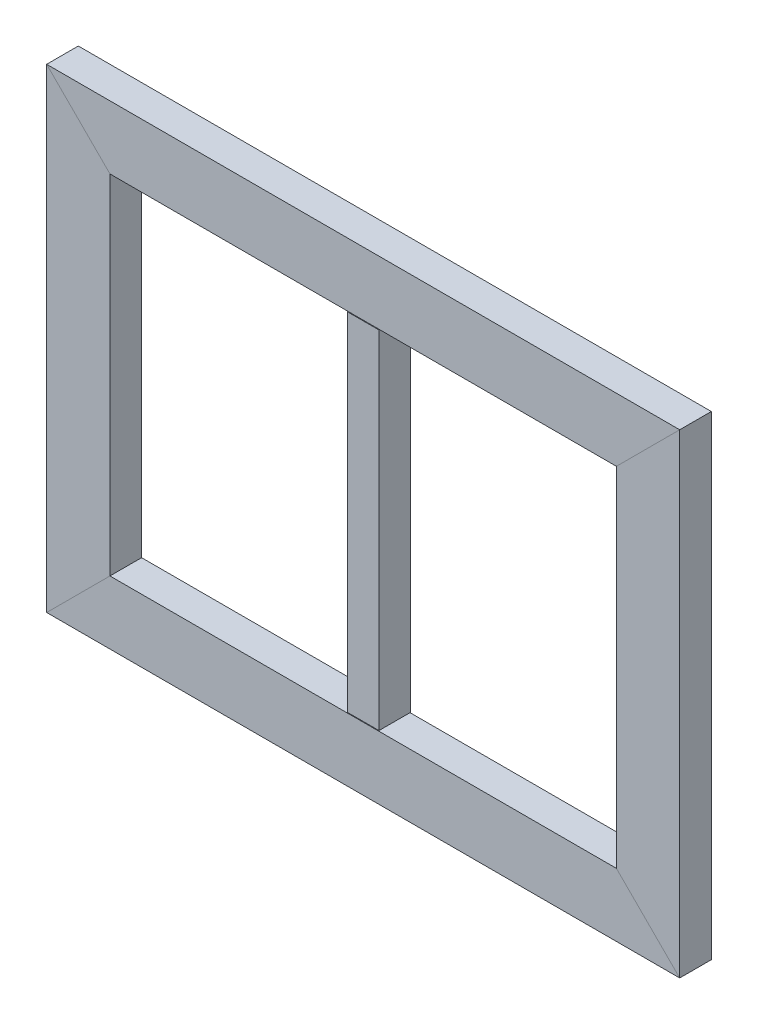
ISO-10303-21;
HEADER;
FILE_DESCRIPTION(('STEP AP214'),'2;1');
FILE_NAME('part.step','',(''),(''),'','','');
FILE_SCHEMA(('AUTOMOTIVE_DESIGN { 1 0 10303 214 1 1 1 1 }'));
ENDSEC;
DATA;
#1=APPLICATION_CONTEXT('core data for automotive mechanical design processes');
#2=APPLICATION_PROTOCOL_DEFINITION('international standard','automotive_design',2000,#1);
#3=PRODUCT_CONTEXT('',#1,'mechanical');
#4=PRODUCT('Part','Part','',(#3));
#5=PRODUCT_RELATED_PRODUCT_CATEGORY('part','',(#4));
#6=PRODUCT_DEFINITION_FORMATION('','',#4);
#7=PRODUCT_DEFINITION_CONTEXT('part definition',#1,'design');
#8=PRODUCT_DEFINITION('design','',#6,#7);
#9=PRODUCT_DEFINITION_SHAPE('','',#8);
#10=(LENGTH_UNIT() NAMED_UNIT(*) SI_UNIT(.MILLI.,.METRE.));
#11=(NAMED_UNIT(*) PLANE_ANGLE_UNIT() SI_UNIT($,.RADIAN.));
#12=(NAMED_UNIT(*) SI_UNIT($,.STERADIAN.) SOLID_ANGLE_UNIT());
#13=UNCERTAINTY_MEASURE_WITH_UNIT(LENGTH_MEASURE(1.E-05),#10,'distance_accuracy_value','');
#14=(GEOMETRIC_REPRESENTATION_CONTEXT(3) GLOBAL_UNCERTAINTY_ASSIGNED_CONTEXT((#13)) GLOBAL_UNIT_ASSIGNED_CONTEXT((#10,
#11,#12)) REPRESENTATION_CONTEXT('',''));
#15=CARTESIAN_POINT('',(0.,0.,0.));
#16=DIRECTION('',(0.,0.,1.));
#17=DIRECTION('',(1.,0.,0.));
#18=AXIS2_PLACEMENT_3D('',#15,#16,#17);
#19=CARTESIAN_POINT('',(24.9999999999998,-375.,25.));
#20=DIRECTION('',(0.,0.,-1.));
#21=DIRECTION('',(-1.,0.,0.));
#22=AXIS2_PLACEMENT_3D('',#19,#20,#21);
#23=PLANE('',#22);
#24=DIRECTION('',(1.,0.,0.));
#25=VECTOR('',#24,1.);
#26=CARTESIAN_POINT('',(24.9999999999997,274.,25.));
#27=LINE('',#26,#25);
#28=CARTESIAN_POINT('',(-25.0000000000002,274.,25.));
#29=VERTEX_POINT('',#28);
#30=CARTESIAN_POINT('',(24.9999999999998,274.,25.));
#31=VERTEX_POINT('',#30);
#32=EDGE_CURVE('E199',#29,#31,#27,.T.);
#33=ORIENTED_EDGE('',*,*,#32,.F.);
#34=DIRECTION('',(0.,1.,0.));
#35=VECTOR('',#34,1.);
#36=CARTESIAN_POINT('',(-25.0000000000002,-375.,25.));
#37=LINE('',#36,#35);
#38=CARTESIAN_POINT('',(-25.0000000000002,-274.,25.));
#39=VERTEX_POINT('',#38);
#40=EDGE_CURVE('E183',#39,#29,#37,.T.);
#41=ORIENTED_EDGE('',*,*,#40,.F.);
#42=DIRECTION('',(-1.,0.,0.));
#43=VECTOR('',#42,1.);
#44=CARTESIAN_POINT('',(24.9999999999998,-274.,25.));
#45=LINE('',#44,#43);
#46=CARTESIAN_POINT('',(24.9999999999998,-274.,25.));
#47=VERTEX_POINT('',#46);
#48=EDGE_CURVE('E200',#47,#39,#45,.T.);
#49=ORIENTED_EDGE('',*,*,#48,.F.);
#50=DIRECTION('',(0.,1.,0.));
#51=VECTOR('',#50,1.);
#52=CARTESIAN_POINT('',(24.9999999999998,-375.,25.));
#53=LINE('',#52,#51);
#54=EDGE_CURVE('E91',#47,#31,#53,.T.);
#55=ORIENTED_EDGE('',*,*,#54,.T.);
#56=EDGE_LOOP('',(#33,#41,#49,#55));
#57=FACE_BOUND('',#56,.T.);
#58=ADVANCED_FACE('F87',(#57),#23,.F.);
#59=CARTESIAN_POINT('',(24.9999999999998,-375.,-25.));
#60=DIRECTION('',(-1.,0.,0.));
#61=DIRECTION('',(0.,0.,1.));
#62=AXIS2_PLACEMENT_3D('',#59,#60,#61);
#63=PLANE('',#62);
#64=DIRECTION('',(0.,0.,-1.));
#65=VECTOR('',#64,1.);
#66=CARTESIAN_POINT('',(24.9999999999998,274.,-25.));
#67=LINE('',#66,#65);
#68=CARTESIAN_POINT('',(24.9999999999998,274.,-25.));
#69=VERTEX_POINT('',#68);
#70=EDGE_CURVE('E178',#31,#69,#67,.T.);
#71=ORIENTED_EDGE('',*,*,#70,.F.);
#72=ORIENTED_EDGE('',*,*,#54,.F.);
#73=DIRECTION('',(0.,0.,1.));
#74=VECTOR('',#73,1.);
#75=CARTESIAN_POINT('',(24.9999999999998,-274.,-25.));
#76=LINE('',#75,#74);
#77=CARTESIAN_POINT('',(24.9999999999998,-274.,-25.));
#78=VERTEX_POINT('',#77);
#79=EDGE_CURVE('E139',#78,#47,#76,.T.);
#80=ORIENTED_EDGE('',*,*,#79,.F.);
#81=DIRECTION('',(0.,1.,0.));
#82=VECTOR('',#81,1.);
#83=CARTESIAN_POINT('',(24.9999999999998,-375.,-25.));
#84=LINE('',#83,#82);
#85=EDGE_CURVE('E189',#78,#69,#84,.T.);
#86=ORIENTED_EDGE('',*,*,#85,.T.);
#87=EDGE_LOOP('',(#71,#72,#80,#86));
#88=FACE_BOUND('',#87,.T.);
#89=ADVANCED_FACE('F201',(#88),#63,.F.);
#90=CARTESIAN_POINT('',(24.9999999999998,-375.,-25.));
#91=DIRECTION('',(0.,0.,1.));
#92=DIRECTION('',(1.,0.,0.));
#93=AXIS2_PLACEMENT_3D('',#90,#91,#92);
#94=PLANE('',#93);
#95=DIRECTION('',(-1.,0.,0.));
#96=VECTOR('',#95,1.);
#97=CARTESIAN_POINT('',(24.9999999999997,274.,-25.));
#98=LINE('',#97,#96);
#99=CARTESIAN_POINT('',(-25.0000000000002,274.,-25.));
#100=VERTEX_POINT('',#99);
#101=EDGE_CURVE('E106',#69,#100,#98,.T.);
#102=ORIENTED_EDGE('',*,*,#101,.F.);
#103=ORIENTED_EDGE('',*,*,#85,.F.);
#104=DIRECTION('',(1.,0.,0.));
#105=VECTOR('',#104,1.);
#106=CARTESIAN_POINT('',(24.9999999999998,-274.,-25.));
#107=LINE('',#106,#105);
#108=CARTESIAN_POINT('',(-25.0000000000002,-274.,-25.));
#109=VERTEX_POINT('',#108);
#110=EDGE_CURVE('E135',#109,#78,#107,.T.);
#111=ORIENTED_EDGE('',*,*,#110,.F.);
#112=DIRECTION('',(0.,1.,0.));
#113=VECTOR('',#112,1.);
#114=CARTESIAN_POINT('',(-25.0000000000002,-375.,-25.));
#115=LINE('',#114,#113);
#116=EDGE_CURVE('E187',#109,#100,#115,.T.);
#117=ORIENTED_EDGE('',*,*,#116,.T.);
#118=EDGE_LOOP('',(#102,#103,#111,#117));
#119=FACE_BOUND('',#118,.T.);
#120=ADVANCED_FACE('F230',(#119),#94,.F.);
#121=CARTESIAN_POINT('',(-25.0000000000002,-375.,-25.));
#122=DIRECTION('',(1.,0.,0.));
#123=DIRECTION('',(0.,0.,-1.));
#124=AXIS2_PLACEMENT_3D('',#121,#122,#123);
#125=PLANE('',#124);
#126=DIRECTION('',(0.,0.,1.));
#127=VECTOR('',#126,1.);
#128=CARTESIAN_POINT('',(-25.0000000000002,274.,-25.));
#129=LINE('',#128,#127);
#130=EDGE_CURVE('E203',#100,#29,#129,.T.);
#131=ORIENTED_EDGE('',*,*,#130,.F.);
#132=ORIENTED_EDGE('',*,*,#116,.F.);
#133=DIRECTION('',(0.,0.,-1.));
#134=VECTOR('',#133,1.);
#135=CARTESIAN_POINT('',(-25.0000000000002,-274.,-25.));
#136=LINE('',#135,#134);
#137=EDGE_CURVE('E186',#39,#109,#136,.T.);
#138=ORIENTED_EDGE('',*,*,#137,.F.);
#139=ORIENTED_EDGE('',*,*,#40,.T.);
#140=EDGE_LOOP('',(#131,#132,#138,#139));
#141=FACE_BOUND('',#140,.T.);
#142=ADVANCED_FACE('F228',(#141),#125,.F.);
#143=CARTESIAN_POINT('',(-500.,-274.,-25.));
#144=DIRECTION('',(0.,-1.,0.));
#145=DIRECTION('',(1.,0.,0.));
#146=AXIS2_PLACEMENT_3D('',#143,#144,#145);
#147=PLANE('',#146);
#148=DIRECTION('',(0.,0.,-1.));
#149=VECTOR('',#148,1.);
#150=CARTESIAN_POINT('',(-22.0000000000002,-274.,-22.));
#151=LINE('',#150,#149);
#152=CARTESIAN_POINT('',(-22.0000000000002,-274.,22.));
#153=VERTEX_POINT('',#152);
#154=CARTESIAN_POINT('',(-22.0000000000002,-274.,-22.));
#155=VERTEX_POINT('',#154);
#156=EDGE_CURVE('E207',#153,#155,#151,.T.);
#157=ORIENTED_EDGE('',*,*,#156,.F.);
#158=DIRECTION('',(-1.,0.,0.));
#159=VECTOR('',#158,1.);
#160=CARTESIAN_POINT('',(21.9999999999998,-274.,22.));
#161=LINE('',#160,#159);
#162=CARTESIAN_POINT('',(21.9999999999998,-274.,22.));
#163=VERTEX_POINT('',#162);
#164=EDGE_CURVE('E173',#163,#153,#161,.T.);
#165=ORIENTED_EDGE('',*,*,#164,.F.);
#166=DIRECTION('',(0.,0.,1.));
#167=VECTOR('',#166,1.);
#168=CARTESIAN_POINT('',(21.9999999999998,-274.,-22.));
#169=LINE('',#168,#167);
#170=CARTESIAN_POINT('',(21.9999999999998,-274.,-22.));
#171=VERTEX_POINT('',#170);
#172=EDGE_CURVE('E163',#171,#163,#169,.T.);
#173=ORIENTED_EDGE('',*,*,#172,.F.);
#174=DIRECTION('',(1.,0.,0.));
#175=VECTOR('',#174,1.);
#176=CARTESIAN_POINT('',(21.9999999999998,-274.,-22.));
#177=LINE('',#176,#175);
#178=EDGE_CURVE('E13',#155,#171,#177,.T.);
#179=ORIENTED_EDGE('',*,*,#178,.F.);
#180=EDGE_LOOP('',(#157,#165,#173,#179));
#181=FACE_BOUND('',#180,.T.);
#182=ORIENTED_EDGE('',*,*,#137,.T.);
#183=ORIENTED_EDGE('',*,*,#110,.T.);
#184=ORIENTED_EDGE('',*,*,#79,.T.);
#185=ORIENTED_EDGE('',*,*,#48,.T.);
#186=EDGE_LOOP('',(#182,#183,#184,#185));
#187=FACE_BOUND('',#186,.T.);
#188=ADVANCED_FACE('F225',(#181,#187),#147,.T.);
#189=CARTESIAN_POINT('',(500.,274.,-25.));
#190=DIRECTION('',(0.,1.,0.));
#191=DIRECTION('',(-1.,0.,0.));
#192=AXIS2_PLACEMENT_3D('',#189,#190,#191);
#193=PLANE('',#192);
#194=DIRECTION('',(0.,0.,-1.));
#195=VECTOR('',#194,1.);
#196=CARTESIAN_POINT('',(21.9999999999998,274.,-22.));
#197=LINE('',#196,#195);
#198=CARTESIAN_POINT('',(21.9999999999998,274.,22.));
#199=VERTEX_POINT('',#198);
#200=CARTESIAN_POINT('',(21.9999999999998,274.,-22.));
#201=VERTEX_POINT('',#200);
#202=EDGE_CURVE('E156',#199,#201,#197,.T.);
#203=ORIENTED_EDGE('',*,*,#202,.F.);
#204=DIRECTION('',(1.,0.,0.));
#205=VECTOR('',#204,1.);
#206=CARTESIAN_POINT('',(21.9999999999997,274.,22.));
#207=LINE('',#206,#205);
#208=CARTESIAN_POINT('',(-22.0000000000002,274.,22.));
#209=VERTEX_POINT('',#208);
#210=EDGE_CURVE('E152',#209,#199,#207,.T.);
#211=ORIENTED_EDGE('',*,*,#210,.F.);
#212=DIRECTION('',(0.,0.,1.));
#213=VECTOR('',#212,1.);
#214=CARTESIAN_POINT('',(-22.0000000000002,274.,-22.));
#215=LINE('',#214,#213);
#216=CARTESIAN_POINT('',(-22.0000000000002,274.,-22.));
#217=VERTEX_POINT('',#216);
#218=EDGE_CURVE('E211',#217,#209,#215,.T.);
#219=ORIENTED_EDGE('',*,*,#218,.F.);
#220=DIRECTION('',(-1.,0.,0.));
#221=VECTOR('',#220,1.);
#222=CARTESIAN_POINT('',(21.9999999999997,274.,-22.));
#223=LINE('',#222,#221);
#224=EDGE_CURVE('E97',#201,#217,#223,.T.);
#225=ORIENTED_EDGE('',*,*,#224,.F.);
#226=EDGE_LOOP('',(#203,#211,#219,#225));
#227=FACE_BOUND('',#226,.T.);
#228=ORIENTED_EDGE('',*,*,#130,.T.);
#229=ORIENTED_EDGE('',*,*,#32,.T.);
#230=ORIENTED_EDGE('',*,*,#70,.T.);
#231=ORIENTED_EDGE('',*,*,#101,.T.);
#232=EDGE_LOOP('',(#228,#229,#230,#231));
#233=FACE_BOUND('',#232,.T.);
#234=ADVANCED_FACE('F157',(#227,#233),#193,.T.);
#235=CARTESIAN_POINT('',(21.9999999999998,-375.,-22.));
#236=DIRECTION('',(-1.,0.,0.));
#237=DIRECTION('',(0.,0.,1.));
#238=AXIS2_PLACEMENT_3D('',#235,#236,#237);
#239=PLANE('',#238);
#240=DIRECTION('',(0.,1.,0.));
#241=VECTOR('',#240,1.);
#242=CARTESIAN_POINT('',(21.9999999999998,-375.,22.));
#243=LINE('',#242,#241);
#244=EDGE_CURVE('E164',#163,#199,#243,.T.);
#245=ORIENTED_EDGE('',*,*,#244,.T.);
#246=ORIENTED_EDGE('',*,*,#202,.T.);
#247=DIRECTION('',(0.,1.,0.));
#248=VECTOR('',#247,1.);
#249=CARTESIAN_POINT('',(21.9999999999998,-375.,-22.));
#250=LINE('',#249,#248);
#251=EDGE_CURVE('E210',#171,#201,#250,.T.);
#252=ORIENTED_EDGE('',*,*,#251,.F.);
#253=ORIENTED_EDGE('',*,*,#172,.T.);
#254=EDGE_LOOP('',(#245,#246,#252,#253));
#255=FACE_BOUND('',#254,.T.);
#256=ADVANCED_FACE('F176',(#255),#239,.T.);
#257=CARTESIAN_POINT('',(21.9999999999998,-375.,22.));
#258=DIRECTION('',(0.,0.,-1.));
#259=DIRECTION('',(-1.,0.,0.));
#260=AXIS2_PLACEMENT_3D('',#257,#258,#259);
#261=PLANE('',#260);
#262=DIRECTION('',(0.,1.,0.));
#263=VECTOR('',#262,1.);
#264=CARTESIAN_POINT('',(-22.0000000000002,-375.,22.));
#265=LINE('',#264,#263);
#266=EDGE_CURVE('E172',#153,#209,#265,.T.);
#267=ORIENTED_EDGE('',*,*,#266,.T.);
#268=ORIENTED_EDGE('',*,*,#210,.T.);
#269=ORIENTED_EDGE('',*,*,#244,.F.);
#270=ORIENTED_EDGE('',*,*,#164,.T.);
#271=EDGE_LOOP('',(#267,#268,#269,#270));
#272=FACE_BOUND('',#271,.T.);
#273=ADVANCED_FACE('F169',(#272),#261,.T.);
#274=CARTESIAN_POINT('',(-22.0000000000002,-375.,-22.));
#275=DIRECTION('',(1.,0.,0.));
#276=DIRECTION('',(0.,0.,-1.));
#277=AXIS2_PLACEMENT_3D('',#274,#275,#276);
#278=PLANE('',#277);
#279=DIRECTION('',(0.,1.,0.));
#280=VECTOR('',#279,1.);
#281=CARTESIAN_POINT('',(-22.0000000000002,-375.,-22.));
#282=LINE('',#281,#280);
#283=EDGE_CURVE('E213',#155,#217,#282,.T.);
#284=ORIENTED_EDGE('',*,*,#283,.T.);
#285=ORIENTED_EDGE('',*,*,#218,.T.);
#286=ORIENTED_EDGE('',*,*,#266,.F.);
#287=ORIENTED_EDGE('',*,*,#156,.T.);
#288=EDGE_LOOP('',(#284,#285,#286,#287));
#289=FACE_BOUND('',#288,.T.);
#290=ADVANCED_FACE('F251',(#289),#278,.T.);
#291=CARTESIAN_POINT('',(21.9999999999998,-375.,-22.));
#292=DIRECTION('',(0.,0.,1.));
#293=DIRECTION('',(1.,0.,0.));
#294=AXIS2_PLACEMENT_3D('',#291,#292,#293);
#295=PLANE('',#294);
#296=ORIENTED_EDGE('',*,*,#251,.T.);
#297=ORIENTED_EDGE('',*,*,#224,.T.);
#298=ORIENTED_EDGE('',*,*,#283,.F.);
#299=ORIENTED_EDGE('',*,*,#178,.T.);
#300=EDGE_LOOP('',(#296,#297,#298,#299));
#301=FACE_BOUND('',#300,.T.);
#302=ADVANCED_FACE('F89',(#301),#295,.T.);
#303=CLOSED_SHELL('',(#58,#89,#120,#142,#188,#234,#256,#273,#290,#302));
#304=MANIFOLD_SOLID_BREP('B2',#303);
#305=CARTESIAN_POINT('',(-400.,375.,-25.));
#306=DIRECTION('',(-1.,0.,0.));
#307=DIRECTION('',(0.,0.,1.));
#308=AXIS2_PLACEMENT_3D('',#305,#306,#307);
#309=PLANE('',#308);
#310=DIRECTION('',(0.,0.,1.));
#311=VECTOR('',#310,1.);
#312=CARTESIAN_POINT('',(-400.,-275.,-25.));
#313=LINE('',#312,#311);
#314=CARTESIAN_POINT('',(-400.,-275.,-25.));
#315=VERTEX_POINT('',#314);
#316=CARTESIAN_POINT('',(-400.,-275.,25.));
#317=VERTEX_POINT('',#316);
#318=EDGE_CURVE('E439',#315,#317,#313,.T.);
#319=ORIENTED_EDGE('',*,*,#318,.F.);
#320=DIRECTION('',(0.,-1.,0.));
#321=VECTOR('',#320,1.);
#322=CARTESIAN_POINT('',(-400.,375.,-25.));
#323=LINE('',#322,#321);
#324=CARTESIAN_POINT('',(-400.,275.,-25.));
#325=VERTEX_POINT('',#324);
#326=EDGE_CURVE('E468',#325,#315,#323,.T.);
#327=ORIENTED_EDGE('',*,*,#326,.F.);
#328=DIRECTION('',(0.,0.,-1.));
#329=VECTOR('',#328,1.);
#330=CARTESIAN_POINT('',(-400.,275.,-25.));
#331=LINE('',#330,#329);
#332=CARTESIAN_POINT('',(-400.,275.,25.));
#333=VERTEX_POINT('',#332);
#334=EDGE_CURVE('E431',#333,#325,#331,.T.);
#335=ORIENTED_EDGE('',*,*,#334,.F.);
#336=DIRECTION('',(0.,-1.,0.));
#337=VECTOR('',#336,1.);
#338=CARTESIAN_POINT('',(-400.,375.,25.));
#339=LINE('',#338,#337);
#340=EDGE_CURVE('E350',#333,#317,#339,.T.);
#341=ORIENTED_EDGE('',*,*,#340,.T.);
#342=EDGE_LOOP('',(#319,#327,#335,#341));
#343=FACE_BOUND('',#342,.T.);
#344=ADVANCED_FACE('F346',(#343),#309,.F.);
#345=CARTESIAN_POINT('',(-500.,375.,-25.));
#346=DIRECTION('',(0.,0.,1.));
#347=DIRECTION('',(1.,0.,0.));
#348=AXIS2_PLACEMENT_3D('',#345,#346,#347);
#349=PLANE('',#348);
#350=DIRECTION('',(0.707106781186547,0.707106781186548,0.));
#351=VECTOR('',#350,1.);
#352=CARTESIAN_POINT('',(-125.,0.,-25.0000000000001));
#353=LINE('',#352,#351);
#354=CARTESIAN_POINT('',(-500.,-375.,-25.));
#355=VERTEX_POINT('',#354);
#356=EDGE_CURVE('E436',#355,#315,#353,.T.);
#357=ORIENTED_EDGE('',*,*,#356,.F.);
#358=DIRECTION('',(0.,-1.,0.));
#359=VECTOR('',#358,1.);
#360=CARTESIAN_POINT('',(-500.,375.,-25.));
#361=LINE('',#360,#359);
#362=CARTESIAN_POINT('',(-500.,375.,-25.));
#363=VERTEX_POINT('',#362);
#364=EDGE_CURVE('E467',#363,#355,#361,.T.);
#365=ORIENTED_EDGE('',*,*,#364,.F.);
#366=DIRECTION('',(-0.707106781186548,0.707106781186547,0.));
#367=VECTOR('',#366,1.);
#368=CARTESIAN_POINT('',(-500.,375.,-25.));
#369=LINE('',#368,#367);
#370=EDGE_CURVE('E435',#325,#363,#369,.T.);
#371=ORIENTED_EDGE('',*,*,#370,.F.);
#372=ORIENTED_EDGE('',*,*,#326,.T.);
#373=EDGE_LOOP('',(#357,#365,#371,#372));
#374=FACE_BOUND('',#373,.T.);
#375=ADVANCED_FACE('F474',(#374),#349,.F.);
#376=CARTESIAN_POINT('',(-500.,375.,-25.));
#377=DIRECTION('',(1.,0.,0.));
#378=DIRECTION('',(0.,0.,-1.));
#379=AXIS2_PLACEMENT_3D('',#376,#377,#378);
#380=PLANE('',#379);
#381=DIRECTION('',(0.,0.,-1.));
#382=VECTOR('',#381,1.);
#383=CARTESIAN_POINT('',(-500.,-375.,-25.));
#384=LINE('',#383,#382);
#385=CARTESIAN_POINT('',(-500.,-375.,25.));
#386=VERTEX_POINT('',#385);
#387=EDGE_CURVE('E85',#386,#355,#384,.T.);
#388=ORIENTED_EDGE('',*,*,#387,.F.);
#389=DIRECTION('',(0.,-1.,0.));
#390=VECTOR('',#389,1.);
#391=CARTESIAN_POINT('',(-500.,375.,25.));
#392=LINE('',#391,#390);
#393=CARTESIAN_POINT('',(-500.,375.,25.));
#394=VERTEX_POINT('',#393);
#395=EDGE_CURVE('E413',#394,#386,#392,.T.);
#396=ORIENTED_EDGE('',*,*,#395,.F.);
#397=DIRECTION('',(0.,0.,1.));
#398=VECTOR('',#397,1.);
#399=CARTESIAN_POINT('',(-500.,375.,-25.));
#400=LINE('',#399,#398);
#401=EDGE_CURVE('E418',#363,#394,#400,.T.);
#402=ORIENTED_EDGE('',*,*,#401,.F.);
#403=ORIENTED_EDGE('',*,*,#364,.T.);
#404=EDGE_LOOP('',(#388,#396,#402,#403));
#405=FACE_BOUND('',#404,.T.);
#406=ADVANCED_FACE('F415',(#405),#380,.F.);
#407=CARTESIAN_POINT('',(-495.,375.,-20.));
#408=DIRECTION('',(0.,0.,1.));
#409=DIRECTION('',(1.,0.,0.));
#410=AXIS2_PLACEMENT_3D('',#407,#408,#409);
#411=PLANE('',#410);
#412=DIRECTION('',(0.,-1.,0.));
#413=VECTOR('',#412,1.);
#414=CARTESIAN_POINT('',(-495.,375.,-20.));
#415=LINE('',#414,#413);
#416=CARTESIAN_POINT('',(-495.,370.,-20.));
#417=VERTEX_POINT('',#416);
#418=CARTESIAN_POINT('',(-495.,-370.,-20.));
#419=VERTEX_POINT('',#418);
#420=EDGE_CURVE('E452',#417,#419,#415,.T.);
#421=ORIENTED_EDGE('',*,*,#420,.T.);
#422=DIRECTION('',(0.707106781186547,0.707106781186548,0.));
#423=VECTOR('',#422,1.);
#424=CARTESIAN_POINT('',(-122.5,2.50000000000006,-20.));
#425=LINE('',#424,#423);
#426=CARTESIAN_POINT('',(-405.,-280.,-20.));
#427=VERTEX_POINT('',#426);
#428=EDGE_CURVE('E380',#419,#427,#425,.T.);
#429=ORIENTED_EDGE('',*,*,#428,.T.);
#430=DIRECTION('',(0.,-1.,0.));
#431=VECTOR('',#430,1.);
#432=CARTESIAN_POINT('',(-405.,375.,-20.));
#433=LINE('',#432,#431);
#434=CARTESIAN_POINT('',(-405.,280.,-20.));
#435=VERTEX_POINT('',#434);
#436=EDGE_CURVE('E455',#435,#427,#433,.T.);
#437=ORIENTED_EDGE('',*,*,#436,.F.);
#438=DIRECTION('',(-0.707106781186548,0.707106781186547,0.));
#439=VECTOR('',#438,1.);
#440=CARTESIAN_POINT('',(-497.5,372.5,-20.));
#441=LINE('',#440,#439);
#442=EDGE_CURVE('E451',#435,#417,#441,.T.);
#443=ORIENTED_EDGE('',*,*,#442,.T.);
#444=EDGE_LOOP('',(#421,#429,#437,#443));
#445=FACE_BOUND('',#444,.T.);
#446=ADVANCED_FACE('F491',(#445),#411,.T.);
#447=CARTESIAN_POINT('',(-405.,375.,-20.));
#448=DIRECTION('',(-1.,0.,0.));
#449=DIRECTION('',(0.,0.,1.));
#450=AXIS2_PLACEMENT_3D('',#447,#448,#449);
#451=PLANE('',#450);
#452=ORIENTED_EDGE('',*,*,#436,.T.);
#453=DIRECTION('',(0.,0.,1.));
#454=VECTOR('',#453,1.);
#455=CARTESIAN_POINT('',(-405.,-280.,-20.));
#456=LINE('',#455,#454);
#457=CARTESIAN_POINT('',(-405.,-280.,20.));
#458=VERTEX_POINT('',#457);
#459=EDGE_CURVE('E365',#427,#458,#456,.T.);
#460=ORIENTED_EDGE('',*,*,#459,.T.);
#461=DIRECTION('',(0.,-1.,0.));
#462=VECTOR('',#461,1.);
#463=CARTESIAN_POINT('',(-405.,375.,20.));
#464=LINE('',#463,#462);
#465=CARTESIAN_POINT('',(-405.,280.,20.));
#466=VERTEX_POINT('',#465);
#467=EDGE_CURVE('E459',#466,#458,#464,.T.);
#468=ORIENTED_EDGE('',*,*,#467,.F.);
#469=DIRECTION('',(0.,0.,-1.));
#470=VECTOR('',#469,1.);
#471=CARTESIAN_POINT('',(-405.,280.,-20.));
#472=LINE('',#471,#470);
#473=EDGE_CURVE('E454',#466,#435,#472,.T.);
#474=ORIENTED_EDGE('',*,*,#473,.T.);
#475=EDGE_LOOP('',(#452,#460,#468,#474));
#476=FACE_BOUND('',#475,.T.);
#477=ADVANCED_FACE('F489',(#476),#451,.T.);
#478=CARTESIAN_POINT('',(-495.,375.,20.));
#479=DIRECTION('',(0.,0.,-1.));
#480=DIRECTION('',(-1.,0.,0.));
#481=AXIS2_PLACEMENT_3D('',#478,#479,#480);
#482=PLANE('',#481);
#483=ORIENTED_EDGE('',*,*,#467,.T.);
#484=DIRECTION('',(-0.707106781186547,-0.707106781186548,0.));
#485=VECTOR('',#484,1.);
#486=CARTESIAN_POINT('',(-122.5,2.50000000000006,20.));
#487=LINE('',#486,#485);
#488=CARTESIAN_POINT('',(-495.,-370.,20.));
#489=VERTEX_POINT('',#488);
#490=EDGE_CURVE('E456',#458,#489,#487,.T.);
#491=ORIENTED_EDGE('',*,*,#490,.T.);
#492=DIRECTION('',(0.,-1.,0.));
#493=VECTOR('',#492,1.);
#494=CARTESIAN_POINT('',(-495.,375.,20.));
#495=LINE('',#494,#493);
#496=CARTESIAN_POINT('',(-495.,370.,20.));
#497=VERTEX_POINT('',#496);
#498=EDGE_CURVE('E447',#497,#489,#495,.T.);
#499=ORIENTED_EDGE('',*,*,#498,.F.);
#500=DIRECTION('',(0.707106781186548,-0.707106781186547,0.));
#501=VECTOR('',#500,1.);
#502=CARTESIAN_POINT('',(-497.5,372.5,20.));
#503=LINE('',#502,#501);
#504=EDGE_CURVE('E458',#497,#466,#503,.T.);
#505=ORIENTED_EDGE('',*,*,#504,.T.);
#506=EDGE_LOOP('',(#483,#491,#499,#505));
#507=FACE_BOUND('',#506,.T.);
#508=ADVANCED_FACE('F484',(#507),#482,.T.);
#509=CARTESIAN_POINT('',(-495.,375.,-20.));
#510=DIRECTION('',(1.,0.,0.));
#511=DIRECTION('',(0.,0.,-1.));
#512=AXIS2_PLACEMENT_3D('',#509,#510,#511);
#513=PLANE('',#512);
#514=ORIENTED_EDGE('',*,*,#498,.T.);
#515=DIRECTION('',(0.,0.,-1.));
#516=VECTOR('',#515,1.);
#517=CARTESIAN_POINT('',(-495.,-370.,-20.));
#518=LINE('',#517,#516);
#519=EDGE_CURVE('E375',#489,#419,#518,.T.);
#520=ORIENTED_EDGE('',*,*,#519,.T.);
#521=ORIENTED_EDGE('',*,*,#420,.F.);
#522=DIRECTION('',(0.,0.,1.));
#523=VECTOR('',#522,1.);
#524=CARTESIAN_POINT('',(-495.,370.,-20.));
#525=LINE('',#524,#523);
#526=EDGE_CURVE('E424',#417,#497,#525,.T.);
#527=ORIENTED_EDGE('',*,*,#526,.T.);
#528=EDGE_LOOP('',(#514,#520,#521,#527));
#529=FACE_BOUND('',#528,.T.);
#530=ADVANCED_FACE('F494',(#529),#513,.T.);
#531=CARTESIAN_POINT('',(-500.,375.,25.));
#532=DIRECTION('',(0.,0.,-1.));
#533=DIRECTION('',(-1.,0.,0.));
#534=AXIS2_PLACEMENT_3D('',#531,#532,#533);
#535=PLANE('',#534);
#536=DIRECTION('',(-0.707106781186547,-0.707106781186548,0.));
#537=VECTOR('',#536,1.);
#538=CARTESIAN_POINT('',(-125.,0.,25.));
#539=LINE('',#538,#537);
#540=EDGE_CURVE('E356',#317,#386,#539,.T.);
#541=ORIENTED_EDGE('',*,*,#540,.F.);
#542=ORIENTED_EDGE('',*,*,#340,.F.);
#543=DIRECTION('',(0.707106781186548,-0.707106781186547,0.));
#544=VECTOR('',#543,1.);
#545=CARTESIAN_POINT('',(-500.,375.,25.));
#546=LINE('',#545,#544);
#547=EDGE_CURVE('E423',#394,#333,#546,.T.);
#548=ORIENTED_EDGE('',*,*,#547,.F.);
#549=ORIENTED_EDGE('',*,*,#395,.T.);
#550=EDGE_LOOP('',(#541,#542,#548,#549));
#551=FACE_BOUND('',#550,.T.);
#552=ADVANCED_FACE('F427',(#551),#535,.F.);
#553=CARTESIAN_POINT('',(-500.,375.,0.));
#554=DIRECTION('',(0.707106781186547,0.707106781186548,0.));
#555=DIRECTION('',(-0.707106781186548,0.707106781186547,0.));
#556=AXIS2_PLACEMENT_3D('',#553,#554,#555);
#557=PLANE('',#556);
#558=ORIENTED_EDGE('',*,*,#442,.F.);
#559=ORIENTED_EDGE('',*,*,#473,.F.);
#560=ORIENTED_EDGE('',*,*,#504,.F.);
#561=ORIENTED_EDGE('',*,*,#526,.F.);
#562=EDGE_LOOP('',(#558,#559,#560,#561));
#563=FACE_BOUND('',#562,.T.);
#564=ORIENTED_EDGE('',*,*,#547,.T.);
#565=ORIENTED_EDGE('',*,*,#334,.T.);
#566=ORIENTED_EDGE('',*,*,#370,.T.);
#567=ORIENTED_EDGE('',*,*,#401,.T.);
#568=EDGE_LOOP('',(#564,#565,#566,#567));
#569=FACE_BOUND('',#568,.T.);
#570=ADVANCED_FACE('F434',(#563,#569),#557,.T.);
#571=CARTESIAN_POINT('',(-500.,-375.,0.));
#572=DIRECTION('',(0.707106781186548,-0.707106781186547,0.));
#573=DIRECTION('',(0.707106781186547,0.707106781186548,0.));
#574=AXIS2_PLACEMENT_3D('',#571,#572,#573);
#575=PLANE('',#574);
#576=ORIENTED_EDGE('',*,*,#428,.F.);
#577=ORIENTED_EDGE('',*,*,#519,.F.);
#578=ORIENTED_EDGE('',*,*,#490,.F.);
#579=ORIENTED_EDGE('',*,*,#459,.F.);
#580=EDGE_LOOP('',(#576,#577,#578,#579));
#581=FACE_BOUND('',#580,.T.);
#582=ORIENTED_EDGE('',*,*,#356,.T.);
#583=ORIENTED_EDGE('',*,*,#318,.T.);
#584=ORIENTED_EDGE('',*,*,#540,.T.);
#585=ORIENTED_EDGE('',*,*,#387,.T.);
#586=EDGE_LOOP('',(#582,#583,#584,#585));
#587=FACE_BOUND('',#586,.T.);
#588=ADVANCED_FACE('F348',(#581,#587),#575,.T.);
#589=CLOSED_SHELL('',(#344,#375,#406,#446,#477,#508,#530,#552,#570,#588));
#590=MANIFOLD_SOLID_BREP('B7',#589);
#591=CARTESIAN_POINT('',(-500.,-275.,-25.));
#592=DIRECTION('',(0.,-1.,0.));
#593=DIRECTION('',(1.,0.,0.));
#594=AXIS2_PLACEMENT_3D('',#591,#592,#593);
#595=PLANE('',#594);
#596=DIRECTION('',(0.,0.,-1.));
#597=VECTOR('',#596,1.);
#598=CARTESIAN_POINT('',(-400.000000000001,-275.,-25.));
#599=LINE('',#598,#597);
#600=CARTESIAN_POINT('',(-400.,-275.,25.));
#601=VERTEX_POINT('',#600);
#602=CARTESIAN_POINT('',(-400.000000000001,-275.,-25.));
#603=VERTEX_POINT('',#602);
#604=EDGE_CURVE('E704',#601,#603,#599,.T.);
#605=ORIENTED_EDGE('',*,*,#604,.F.);
#606=DIRECTION('',(1.,0.,0.));
#607=VECTOR('',#606,1.);
#608=CARTESIAN_POINT('',(-500.,-275.,25.));
#609=LINE('',#608,#607);
#610=CARTESIAN_POINT('',(400.,-275.,25.));
#611=VERTEX_POINT('',#610);
#612=EDGE_CURVE('E628',#601,#611,#609,.T.);
#613=ORIENTED_EDGE('',*,*,#612,.T.);
#614=DIRECTION('',(0.,0.,1.));
#615=VECTOR('',#614,1.);
#616=CARTESIAN_POINT('',(400.,-275.,-25.));
#617=LINE('',#616,#615);
#618=CARTESIAN_POINT('',(400.,-275.,-25.));
#619=VERTEX_POINT('',#618);
#620=EDGE_CURVE('E738',#619,#611,#617,.T.);
#621=ORIENTED_EDGE('',*,*,#620,.F.);
#622=DIRECTION('',(1.,0.,0.));
#623=VECTOR('',#622,1.);
#624=CARTESIAN_POINT('',(-500.,-275.,-25.));
#625=LINE('',#624,#623);
#626=EDGE_CURVE('E733',#603,#619,#625,.T.);
#627=ORIENTED_EDGE('',*,*,#626,.F.);
#628=EDGE_LOOP('',(#605,#613,#621,#627));
#629=FACE_BOUND('',#628,.T.);
#630=ADVANCED_FACE('F624',(#629),#595,.F.);
#631=CARTESIAN_POINT('',(-500.,-375.000000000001,-25.));
#632=DIRECTION('',(0.,0.,1.));
#633=DIRECTION('',(0.,-1.,0.));
#634=AXIS2_PLACEMENT_3D('',#631,#632,#633);
#635=PLANE('',#634);
#636=DIRECTION('',(-0.707106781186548,-0.707106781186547,0.));
#637=VECTOR('',#636,1.);
#638=CARTESIAN_POINT('',(-500.000000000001,-375.,-25.));
#639=LINE('',#638,#637);
#640=CARTESIAN_POINT('',(-500.000000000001,-375.000000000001,-25.));
#641=VERTEX_POINT('',#640);
#642=EDGE_CURVE('E634',#603,#641,#639,.T.);
#643=ORIENTED_EDGE('',*,*,#642,.F.);
#644=ORIENTED_EDGE('',*,*,#626,.T.);
#645=DIRECTION('',(-0.707106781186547,0.707106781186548,0.));
#646=VECTOR('',#645,1.);
#647=CARTESIAN_POINT('',(0.,125.,-25.0000000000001));
#648=LINE('',#647,#646);
#649=CARTESIAN_POINT('',(500.,-375.,-25.));
#650=VERTEX_POINT('',#649);
#651=EDGE_CURVE('E694',#650,#619,#648,.T.);
#652=ORIENTED_EDGE('',*,*,#651,.F.);
#653=DIRECTION('',(1.,0.,0.));
#654=VECTOR('',#653,1.);
#655=CARTESIAN_POINT('',(-500.,-375.000000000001,-25.));
#656=LINE('',#655,#654);
#657=EDGE_CURVE('E716',#641,#650,#656,.T.);
#658=ORIENTED_EDGE('',*,*,#657,.F.);
#659=EDGE_LOOP('',(#643,#644,#652,#658));
#660=FACE_BOUND('',#659,.T.);
#661=ADVANCED_FACE('F781',(#660),#635,.F.);
#662=CARTESIAN_POINT('',(-500.,-375.000000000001,-25.));
#663=DIRECTION('',(0.,1.,0.));
#664=DIRECTION('',(-1.,0.,0.));
#665=AXIS2_PLACEMENT_3D('',#662,#663,#664);
#666=PLANE('',#665);
#667=DIRECTION('',(0.,0.,1.));
#668=VECTOR('',#667,1.);
#669=CARTESIAN_POINT('',(-500.000000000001,-375.000000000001,-25.));
#670=LINE('',#669,#668);
#671=CARTESIAN_POINT('',(-500.000000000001,-375.000000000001,25.));
#672=VERTEX_POINT('',#671);
#673=EDGE_CURVE('E344',#641,#672,#670,.T.);
#674=ORIENTED_EDGE('',*,*,#673,.F.);
#675=ORIENTED_EDGE('',*,*,#657,.T.);
#676=DIRECTION('',(0.,0.,-1.));
#677=VECTOR('',#676,1.);
#678=CARTESIAN_POINT('',(500.,-375.,-25.));
#679=LINE('',#678,#677);
#680=CARTESIAN_POINT('',(500.,-375.000000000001,25.));
#681=VERTEX_POINT('',#680);
#682=EDGE_CURVE('E690',#681,#650,#679,.T.);
#683=ORIENTED_EDGE('',*,*,#682,.F.);
#684=DIRECTION('',(1.,0.,0.));
#685=VECTOR('',#684,1.);
#686=CARTESIAN_POINT('',(-500.,-375.000000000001,25.));
#687=LINE('',#686,#685);
#688=EDGE_CURVE('E685',#672,#681,#687,.T.);
#689=ORIENTED_EDGE('',*,*,#688,.F.);
#690=EDGE_LOOP('',(#674,#675,#683,#689));
#691=FACE_BOUND('',#690,.T.);
#692=ADVANCED_FACE('F687',(#691),#666,.F.);
#693=CARTESIAN_POINT('',(-500.,-370.000000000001,-20.));
#694=DIRECTION('',(0.,0.,1.));
#695=DIRECTION('',(0.,-1.,0.));
#696=AXIS2_PLACEMENT_3D('',#693,#694,#695);
#697=PLANE('',#696);
#698=DIRECTION('',(1.,0.,0.));
#699=VECTOR('',#698,1.);
#700=CARTESIAN_POINT('',(-500.,-280.,-20.));
#701=LINE('',#700,#699);
#702=CARTESIAN_POINT('',(-405.000000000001,-280.,-20.));
#703=VERTEX_POINT('',#702);
#704=CARTESIAN_POINT('',(405.,-280.,-20.));
#705=VERTEX_POINT('',#704);
#706=EDGE_CURVE('E720',#703,#705,#701,.T.);
#707=ORIENTED_EDGE('',*,*,#706,.F.);
#708=DIRECTION('',(-0.707106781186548,-0.707106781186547,0.));
#709=VECTOR('',#708,1.);
#710=CARTESIAN_POINT('',(-497.500000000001,-372.5,-20.));
#711=LINE('',#710,#709);
#712=CARTESIAN_POINT('',(-495.000000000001,-370.000000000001,-20.));
#713=VERTEX_POINT('',#712);
#714=EDGE_CURVE('E713',#703,#713,#711,.T.);
#715=ORIENTED_EDGE('',*,*,#714,.T.);
#716=DIRECTION('',(1.,0.,0.));
#717=VECTOR('',#716,1.);
#718=CARTESIAN_POINT('',(-500.,-370.000000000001,-20.));
#719=LINE('',#718,#717);
#720=CARTESIAN_POINT('',(495.,-370.,-20.));
#721=VERTEX_POINT('',#720);
#722=EDGE_CURVE('E715',#713,#721,#719,.T.);
#723=ORIENTED_EDGE('',*,*,#722,.T.);
#724=DIRECTION('',(-0.707106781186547,0.707106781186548,0.));
#725=VECTOR('',#724,1.);
#726=CARTESIAN_POINT('',(-2.5,127.5,-20.0000000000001));
#727=LINE('',#726,#725);
#728=EDGE_CURVE('E721',#721,#705,#727,.T.);
#729=ORIENTED_EDGE('',*,*,#728,.T.);
#730=EDGE_LOOP('',(#707,#715,#723,#729));
#731=FACE_BOUND('',#730,.T.);
#732=ADVANCED_FACE('F763',(#731),#697,.T.);
#733=CARTESIAN_POINT('',(-500.,-280.,-20.));
#734=DIRECTION('',(0.,-1.,0.));
#735=DIRECTION('',(1.,0.,0.));
#736=AXIS2_PLACEMENT_3D('',#733,#734,#735);
#737=PLANE('',#736);
#738=DIRECTION('',(1.,0.,0.));
#739=VECTOR('',#738,1.);
#740=CARTESIAN_POINT('',(-500.,-280.,20.));
#741=LINE('',#740,#739);
#742=CARTESIAN_POINT('',(-405.,-280.,20.));
#743=VERTEX_POINT('',#742);
#744=CARTESIAN_POINT('',(405.,-280.,20.));
#745=VERTEX_POINT('',#744);
#746=EDGE_CURVE('E724',#743,#745,#741,.T.);
#747=ORIENTED_EDGE('',*,*,#746,.F.);
#748=DIRECTION('',(0.,0.,-1.));
#749=VECTOR('',#748,1.);
#750=CARTESIAN_POINT('',(-405.000000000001,-280.,-20.));
#751=LINE('',#750,#749);
#752=EDGE_CURVE('E717',#743,#703,#751,.T.);
#753=ORIENTED_EDGE('',*,*,#752,.T.);
#754=ORIENTED_EDGE('',*,*,#706,.T.);
#755=DIRECTION('',(0.,0.,1.));
#756=VECTOR('',#755,1.);
#757=CARTESIAN_POINT('',(405.,-280.,-20.));
#758=LINE('',#757,#756);
#759=EDGE_CURVE('E725',#705,#745,#758,.T.);
#760=ORIENTED_EDGE('',*,*,#759,.T.);
#761=EDGE_LOOP('',(#747,#753,#754,#760));
#762=FACE_BOUND('',#761,.T.);
#763=ADVANCED_FACE('F771',(#762),#737,.T.);
#764=CARTESIAN_POINT('',(-500.,-370.000000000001,20.));
#765=DIRECTION('',(0.,0.,-1.));
#766=DIRECTION('',(0.,1.,0.));
#767=AXIS2_PLACEMENT_3D('',#764,#765,#766);
#768=PLANE('',#767);
#769=DIRECTION('',(1.,0.,0.));
#770=VECTOR('',#769,1.);
#771=CARTESIAN_POINT('',(-500.,-370.000000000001,20.));
#772=LINE('',#771,#770);
#773=CARTESIAN_POINT('',(-495.000000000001,-370.000000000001,20.));
#774=VERTEX_POINT('',#773);
#775=CARTESIAN_POINT('',(495.,-370.,20.));
#776=VERTEX_POINT('',#775);
#777=EDGE_CURVE('E727',#774,#776,#772,.T.);
#778=ORIENTED_EDGE('',*,*,#777,.F.);
#779=DIRECTION('',(0.707106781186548,0.707106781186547,0.));
#780=VECTOR('',#779,1.);
#781=CARTESIAN_POINT('',(-497.500000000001,-372.5,20.));
#782=LINE('',#781,#780);
#783=EDGE_CURVE('E722',#774,#743,#782,.T.);
#784=ORIENTED_EDGE('',*,*,#783,.T.);
#785=ORIENTED_EDGE('',*,*,#746,.T.);
#786=DIRECTION('',(0.707106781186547,-0.707106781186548,0.));
#787=VECTOR('',#786,1.);
#788=CARTESIAN_POINT('',(-2.5,127.5,19.9999999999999));
#789=LINE('',#788,#787);
#790=EDGE_CURVE('E730',#745,#776,#789,.T.);
#791=ORIENTED_EDGE('',*,*,#790,.T.);
#792=EDGE_LOOP('',(#778,#784,#785,#791));
#793=FACE_BOUND('',#792,.T.);
#794=ADVANCED_FACE('F768',(#793),#768,.T.);
#795=CARTESIAN_POINT('',(-500.,-370.000000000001,-20.));
#796=DIRECTION('',(0.,1.,0.));
#797=DIRECTION('',(-1.,0.,0.));
#798=AXIS2_PLACEMENT_3D('',#795,#796,#797);
#799=PLANE('',#798);
#800=ORIENTED_EDGE('',*,*,#722,.F.);
#801=DIRECTION('',(0.,0.,1.));
#802=VECTOR('',#801,1.);
#803=CARTESIAN_POINT('',(-495.000000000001,-370.000000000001,-20.));
#804=LINE('',#803,#802);
#805=EDGE_CURVE('E642',#713,#774,#804,.T.);
#806=ORIENTED_EDGE('',*,*,#805,.T.);
#807=ORIENTED_EDGE('',*,*,#777,.T.);
#808=DIRECTION('',(0.,0.,-1.));
#809=VECTOR('',#808,1.);
#810=CARTESIAN_POINT('',(495.,-370.,-20.));
#811=LINE('',#810,#809);
#812=EDGE_CURVE('E695',#776,#721,#811,.T.);
#813=ORIENTED_EDGE('',*,*,#812,.T.);
#814=EDGE_LOOP('',(#800,#806,#807,#813));
#815=FACE_BOUND('',#814,.T.);
#816=ADVANCED_FACE('F767',(#815),#799,.T.);
#817=CARTESIAN_POINT('',(-500.,-375.000000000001,25.));
#818=DIRECTION('',(0.,0.,-1.));
#819=DIRECTION('',(0.,1.,0.));
#820=AXIS2_PLACEMENT_3D('',#817,#818,#819);
#821=PLANE('',#820);
#822=DIRECTION('',(0.707106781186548,0.707106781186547,0.));
#823=VECTOR('',#822,1.);
#824=CARTESIAN_POINT('',(-500.000000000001,-375.,25.));
#825=LINE('',#824,#823);
#826=EDGE_CURVE('E699',#672,#601,#825,.T.);
#827=ORIENTED_EDGE('',*,*,#826,.F.);
#828=ORIENTED_EDGE('',*,*,#688,.T.);
#829=DIRECTION('',(0.707106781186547,-0.707106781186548,0.));
#830=VECTOR('',#829,1.);
#831=CARTESIAN_POINT('',(0.,125.,24.9999999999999));
#832=LINE('',#831,#830);
#833=EDGE_CURVE('E740',#611,#681,#832,.T.);
#834=ORIENTED_EDGE('',*,*,#833,.F.);
#835=ORIENTED_EDGE('',*,*,#612,.F.);
#836=EDGE_LOOP('',(#827,#828,#834,#835));
#837=FACE_BOUND('',#836,.T.);
#838=ADVANCED_FACE('F700',(#837),#821,.F.);
#839=CARTESIAN_POINT('',(500.,-375.,0.));
#840=DIRECTION('',(0.707106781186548,0.707106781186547,0.));
#841=DIRECTION('',(-0.707106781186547,0.707106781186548,0.));
#842=AXIS2_PLACEMENT_3D('',#839,#840,#841);
#843=PLANE('',#842);
#844=ORIENTED_EDGE('',*,*,#728,.F.);
#845=ORIENTED_EDGE('',*,*,#812,.F.);
#846=ORIENTED_EDGE('',*,*,#790,.F.);
#847=ORIENTED_EDGE('',*,*,#759,.F.);
#848=EDGE_LOOP('',(#844,#845,#846,#847));
#849=FACE_BOUND('',#848,.T.);
#850=ORIENTED_EDGE('',*,*,#651,.T.);
#851=ORIENTED_EDGE('',*,*,#620,.T.);
#852=ORIENTED_EDGE('',*,*,#833,.T.);
#853=ORIENTED_EDGE('',*,*,#682,.T.);
#854=EDGE_LOOP('',(#850,#851,#852,#853));
#855=FACE_BOUND('',#854,.T.);
#856=ADVANCED_FACE('F743',(#849,#855),#843,.T.);
#857=CARTESIAN_POINT('',(-500.,-375.,0.));
#858=DIRECTION('',(-0.707106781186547,0.707106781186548,0.));
#859=DIRECTION('',(-0.707106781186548,-0.707106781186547,0.));
#860=AXIS2_PLACEMENT_3D('',#857,#858,#859);
#861=PLANE('',#860);
#862=ORIENTED_EDGE('',*,*,#714,.F.);
#863=ORIENTED_EDGE('',*,*,#752,.F.);
#864=ORIENTED_EDGE('',*,*,#783,.F.);
#865=ORIENTED_EDGE('',*,*,#805,.F.);
#866=EDGE_LOOP('',(#862,#863,#864,#865));
#867=FACE_BOUND('',#866,.T.);
#868=ORIENTED_EDGE('',*,*,#826,.T.);
#869=ORIENTED_EDGE('',*,*,#604,.T.);
#870=ORIENTED_EDGE('',*,*,#642,.T.);
#871=ORIENTED_EDGE('',*,*,#673,.T.);
#872=EDGE_LOOP('',(#868,#869,#870,#871));
#873=FACE_BOUND('',#872,.T.);
#874=ADVANCED_FACE('F626',(#867,#873),#861,.T.);
#875=CLOSED_SHELL('',(#630,#661,#692,#732,#763,#794,#816,#838,#856,#874));
#876=MANIFOLD_SOLID_BREP('B79',#875);
#877=CARTESIAN_POINT('',(500.,275.,-25.));
#878=DIRECTION('',(0.,1.,0.));
#879=DIRECTION('',(-1.,0.,0.));
#880=AXIS2_PLACEMENT_3D('',#877,#878,#879);
#881=PLANE('',#880);
#882=DIRECTION('',(0.,0.,1.));
#883=VECTOR('',#882,1.);
#884=CARTESIAN_POINT('',(-400.,275.,-25.));
#885=LINE('',#884,#883);
#886=CARTESIAN_POINT('',(-400.,275.,-25.));
#887=VERTEX_POINT('',#886);
#888=CARTESIAN_POINT('',(-400.,275.,25.));
#889=VERTEX_POINT('',#888);
#890=EDGE_CURVE('E994',#887,#889,#885,.T.);
#891=ORIENTED_EDGE('',*,*,#890,.F.);
#892=DIRECTION('',(-1.,0.,0.));
#893=VECTOR('',#892,1.);
#894=CARTESIAN_POINT('',(500.,275.,-25.));
#895=LINE('',#894,#893);
#896=CARTESIAN_POINT('',(400.,275.,-25.));
#897=VERTEX_POINT('',#896);
#898=EDGE_CURVE('E1023',#897,#887,#895,.T.);
#899=ORIENTED_EDGE('',*,*,#898,.F.);
#900=DIRECTION('',(0.,0.,-1.));
#901=VECTOR('',#900,1.);
#902=CARTESIAN_POINT('',(400.,275.,-25.));
#903=LINE('',#902,#901);
#904=CARTESIAN_POINT('',(400.,275.,25.));
#905=VERTEX_POINT('',#904);
#906=EDGE_CURVE('E986',#905,#897,#903,.T.);
#907=ORIENTED_EDGE('',*,*,#906,.F.);
#908=DIRECTION('',(-1.,0.,0.));
#909=VECTOR('',#908,1.);
#910=CARTESIAN_POINT('',(500.,275.,25.));
#911=LINE('',#910,#909);
#912=EDGE_CURVE('E905',#905,#889,#911,.T.);
#913=ORIENTED_EDGE('',*,*,#912,.T.);
#914=EDGE_LOOP('',(#891,#899,#907,#913));
#915=FACE_BOUND('',#914,.T.);
#916=ADVANCED_FACE('F901',(#915),#881,.F.);
#917=CARTESIAN_POINT('',(500.,375.,-25.));
#918=DIRECTION('',(0.,0.,1.));
#919=DIRECTION('',(0.,-1.,0.));
#920=AXIS2_PLACEMENT_3D('',#917,#918,#919);
#921=PLANE('',#920);
#922=DIRECTION('',(0.707106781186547,-0.707106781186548,0.));
#923=VECTOR('',#922,1.);
#924=CARTESIAN_POINT('',(-3.33066907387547E-13,-125.,-25.0000000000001));
#925=LINE('',#924,#923);
#926=CARTESIAN_POINT('',(-500.,375.,-25.));
#927=VERTEX_POINT('',#926);
#928=EDGE_CURVE('E991',#927,#887,#925,.T.);
#929=ORIENTED_EDGE('',*,*,#928,.F.);
#930=DIRECTION('',(-1.,0.,0.));
#931=VECTOR('',#930,1.);
#932=CARTESIAN_POINT('',(500.,375.,-25.));
#933=LINE('',#932,#931);
#934=CARTESIAN_POINT('',(500.,375.,-25.));
#935=VERTEX_POINT('',#934);
#936=EDGE_CURVE('E1022',#935,#927,#933,.T.);
#937=ORIENTED_EDGE('',*,*,#936,.F.);
#938=DIRECTION('',(0.707106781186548,0.707106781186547,0.));
#939=VECTOR('',#938,1.);
#940=CARTESIAN_POINT('',(500.,375.,-25.));
#941=LINE('',#940,#939);
#942=EDGE_CURVE('E990',#897,#935,#941,.T.);
#943=ORIENTED_EDGE('',*,*,#942,.F.);
#944=ORIENTED_EDGE('',*,*,#898,.T.);
#945=EDGE_LOOP('',(#929,#937,#943,#944));
#946=FACE_BOUND('',#945,.T.);
#947=ADVANCED_FACE('F1029',(#946),#921,.F.);
#948=CARTESIAN_POINT('',(500.,375.,-25.));
#949=DIRECTION('',(0.,-1.,0.));
#950=DIRECTION('',(1.,0.,0.));
#951=AXIS2_PLACEMENT_3D('',#948,#949,#950);
#952=PLANE('',#951);
#953=DIRECTION('',(0.,0.,-1.));
#954=VECTOR('',#953,1.);
#955=CARTESIAN_POINT('',(-500.,375.,-25.));
#956=LINE('',#955,#954);
#957=CARTESIAN_POINT('',(-500.000000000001,375.000000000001,25.));
#958=VERTEX_POINT('',#957);
#959=EDGE_CURVE('E622',#958,#927,#956,.T.);
#960=ORIENTED_EDGE('',*,*,#959,.F.);
#961=DIRECTION('',(-1.,0.,0.));
#962=VECTOR('',#961,1.);
#963=CARTESIAN_POINT('',(500.,375.,25.));
#964=LINE('',#963,#962);
#965=CARTESIAN_POINT('',(500.,375.,25.));
#966=VERTEX_POINT('',#965);
#967=EDGE_CURVE('E968',#966,#958,#964,.T.);
#968=ORIENTED_EDGE('',*,*,#967,.F.);
#969=DIRECTION('',(0.,0.,1.));
#970=VECTOR('',#969,1.);
#971=CARTESIAN_POINT('',(500.,375.,-25.));
#972=LINE('',#971,#970);
#973=EDGE_CURVE('E973',#935,#966,#972,.T.);
#974=ORIENTED_EDGE('',*,*,#973,.F.);
#975=ORIENTED_EDGE('',*,*,#936,.T.);
#976=EDGE_LOOP('',(#960,#968,#974,#975));
#977=FACE_BOUND('',#976,.T.);
#978=ADVANCED_FACE('F970',(#977),#952,.F.);
#979=CARTESIAN_POINT('',(500.,370.,-20.));
#980=DIRECTION('',(0.,0.,1.));
#981=DIRECTION('',(0.,-1.,0.));
#982=AXIS2_PLACEMENT_3D('',#979,#980,#981);
#983=PLANE('',#982);
#984=DIRECTION('',(-1.,0.,0.));
#985=VECTOR('',#984,1.);
#986=CARTESIAN_POINT('',(500.,370.,-20.));
#987=LINE('',#986,#985);
#988=CARTESIAN_POINT('',(495.,370.,-20.));
#989=VERTEX_POINT('',#988);
#990=CARTESIAN_POINT('',(-495.,370.,-20.));
#991=VERTEX_POINT('',#990);
#992=EDGE_CURVE('E1007',#989,#991,#987,.T.);
#993=ORIENTED_EDGE('',*,*,#992,.T.);
#994=DIRECTION('',(0.707106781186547,-0.707106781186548,0.));
#995=VECTOR('',#994,1.);
#996=CARTESIAN_POINT('',(2.49999999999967,-127.5,-20.0000000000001));
#997=LINE('',#996,#995);
#998=CARTESIAN_POINT('',(-405.,280.,-20.));
#999=VERTEX_POINT('',#998);
#1000=EDGE_CURVE('E935',#991,#999,#997,.T.);
#1001=ORIENTED_EDGE('',*,*,#1000,.T.);
#1002=DIRECTION('',(-1.,0.,0.));
#1003=VECTOR('',#1002,1.);
#1004=CARTESIAN_POINT('',(500.,280.,-20.));
#1005=LINE('',#1004,#1003);
#1006=CARTESIAN_POINT('',(405.,280.,-20.));
#1007=VERTEX_POINT('',#1006);
#1008=EDGE_CURVE('E1010',#1007,#999,#1005,.T.);
#1009=ORIENTED_EDGE('',*,*,#1008,.F.);
#1010=DIRECTION('',(0.707106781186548,0.707106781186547,0.));
#1011=VECTOR('',#1010,1.);
#1012=CARTESIAN_POINT('',(497.5,372.5,-20.));
#1013=LINE('',#1012,#1011);
#1014=EDGE_CURVE('E1006',#1007,#989,#1013,.T.);
#1015=ORIENTED_EDGE('',*,*,#1014,.T.);
#1016=EDGE_LOOP('',(#993,#1001,#1009,#1015));
#1017=FACE_BOUND('',#1016,.T.);
#1018=ADVANCED_FACE('F1046',(#1017),#983,.T.);
#1019=CARTESIAN_POINT('',(500.,280.,-20.));
#1020=DIRECTION('',(0.,1.,0.));
#1021=DIRECTION('',(-1.,0.,0.));
#1022=AXIS2_PLACEMENT_3D('',#1019,#1020,#1021);
#1023=PLANE('',#1022);
#1024=ORIENTED_EDGE('',*,*,#1008,.T.);
#1025=DIRECTION('',(0.,0.,1.));
#1026=VECTOR('',#1025,1.);
#1027=CARTESIAN_POINT('',(-405.,280.,-20.));
#1028=LINE('',#1027,#1026);
#1029=CARTESIAN_POINT('',(-405.,279.999999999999,20.));
#1030=VERTEX_POINT('',#1029);
#1031=EDGE_CURVE('E920',#999,#1030,#1028,.T.);
#1032=ORIENTED_EDGE('',*,*,#1031,.T.);
#1033=DIRECTION('',(-1.,0.,0.));
#1034=VECTOR('',#1033,1.);
#1035=CARTESIAN_POINT('',(500.,280.,20.));
#1036=LINE('',#1035,#1034);
#1037=CARTESIAN_POINT('',(405.,280.,20.));
#1038=VERTEX_POINT('',#1037);
#1039=EDGE_CURVE('E1014',#1038,#1030,#1036,.T.);
#1040=ORIENTED_EDGE('',*,*,#1039,.F.);
#1041=DIRECTION('',(0.,0.,-1.));
#1042=VECTOR('',#1041,1.);
#1043=CARTESIAN_POINT('',(405.,280.,-20.));
#1044=LINE('',#1043,#1042);
#1045=EDGE_CURVE('E1009',#1038,#1007,#1044,.T.);
#1046=ORIENTED_EDGE('',*,*,#1045,.T.);
#1047=EDGE_LOOP('',(#1024,#1032,#1040,#1046));
#1048=FACE_BOUND('',#1047,.T.);
#1049=ADVANCED_FACE('F1044',(#1048),#1023,.T.);
#1050=CARTESIAN_POINT('',(500.,370.,20.));
#1051=DIRECTION('',(0.,0.,-1.));
#1052=DIRECTION('',(0.,1.,0.));
#1053=AXIS2_PLACEMENT_3D('',#1050,#1051,#1052);
#1054=PLANE('',#1053);
#1055=ORIENTED_EDGE('',*,*,#1039,.T.);
#1056=DIRECTION('',(-0.707106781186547,0.707106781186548,0.));
#1057=VECTOR('',#1056,1.);
#1058=CARTESIAN_POINT('',(2.49999999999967,-127.5,19.9999999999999));
#1059=LINE('',#1058,#1057);
#1060=CARTESIAN_POINT('',(-495.,370.,20.));
#1061=VERTEX_POINT('',#1060);
#1062=EDGE_CURVE('E1011',#1030,#1061,#1059,.T.);
#1063=ORIENTED_EDGE('',*,*,#1062,.T.);
#1064=DIRECTION('',(-1.,0.,0.));
#1065=VECTOR('',#1064,1.);
#1066=CARTESIAN_POINT('',(500.,370.,20.));
#1067=LINE('',#1066,#1065);
#1068=CARTESIAN_POINT('',(495.,370.,20.));
#1069=VERTEX_POINT('',#1068);
#1070=EDGE_CURVE('E1002',#1069,#1061,#1067,.T.);
#1071=ORIENTED_EDGE('',*,*,#1070,.F.);
#1072=DIRECTION('',(-0.707106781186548,-0.707106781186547,0.));
#1073=VECTOR('',#1072,1.);
#1074=CARTESIAN_POINT('',(497.5,372.5,20.));
#1075=LINE('',#1074,#1073);
#1076=EDGE_CURVE('E1013',#1069,#1038,#1075,.T.);
#1077=ORIENTED_EDGE('',*,*,#1076,.T.);
#1078=EDGE_LOOP('',(#1055,#1063,#1071,#1077));
#1079=FACE_BOUND('',#1078,.T.);
#1080=ADVANCED_FACE('F1039',(#1079),#1054,.T.);
#1081=CARTESIAN_POINT('',(500.,370.,-20.));
#1082=DIRECTION('',(0.,-1.,0.));
#1083=DIRECTION('',(1.,0.,0.));
#1084=AXIS2_PLACEMENT_3D('',#1081,#1082,#1083);
#1085=PLANE('',#1084);
#1086=ORIENTED_EDGE('',*,*,#1070,.T.);
#1087=DIRECTION('',(0.,0.,-1.));
#1088=VECTOR('',#1087,1.);
#1089=CARTESIAN_POINT('',(-495.,370.,-20.));
#1090=LINE('',#1089,#1088);
#1091=EDGE_CURVE('E930',#1061,#991,#1090,.T.);
#1092=ORIENTED_EDGE('',*,*,#1091,.T.);
#1093=ORIENTED_EDGE('',*,*,#992,.F.);
#1094=DIRECTION('',(0.,0.,1.));
#1095=VECTOR('',#1094,1.);
#1096=CARTESIAN_POINT('',(495.,370.,-20.));
#1097=LINE('',#1096,#1095);
#1098=EDGE_CURVE('E979',#989,#1069,#1097,.T.);
#1099=ORIENTED_EDGE('',*,*,#1098,.T.);
#1100=EDGE_LOOP('',(#1086,#1092,#1093,#1099));
#1101=FACE_BOUND('',#1100,.T.);
#1102=ADVANCED_FACE('F1049',(#1101),#1085,.T.);
#1103=CARTESIAN_POINT('',(500.,375.,25.));
#1104=DIRECTION('',(0.,0.,-1.));
#1105=DIRECTION('',(0.,1.,0.));
#1106=AXIS2_PLACEMENT_3D('',#1103,#1104,#1105);
#1107=PLANE('',#1106);
#1108=DIRECTION('',(-0.707106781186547,0.707106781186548,0.));
#1109=VECTOR('',#1108,1.);
#1110=CARTESIAN_POINT('',(-3.33066907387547E-13,-125.,24.9999999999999));
#1111=LINE('',#1110,#1109);
#1112=EDGE_CURVE('E911',#889,#958,#1111,.T.);
#1113=ORIENTED_EDGE('',*,*,#1112,.F.);
#1114=ORIENTED_EDGE('',*,*,#912,.F.);
#1115=DIRECTION('',(-0.707106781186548,-0.707106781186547,0.));
#1116=VECTOR('',#1115,1.);
#1117=CARTESIAN_POINT('',(500.,375.,25.));
#1118=LINE('',#1117,#1116);
#1119=EDGE_CURVE('E978',#966,#905,#1118,.T.);
#1120=ORIENTED_EDGE('',*,*,#1119,.F.);
#1121=ORIENTED_EDGE('',*,*,#967,.T.);
#1122=EDGE_LOOP('',(#1113,#1114,#1120,#1121));
#1123=FACE_BOUND('',#1122,.T.);
#1124=ADVANCED_FACE('F982',(#1123),#1107,.F.);
#1125=CARTESIAN_POINT('',(500.,375.,0.));
#1126=DIRECTION('',(0.707106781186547,-0.707106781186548,0.));
#1127=DIRECTION('',(0.707106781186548,0.707106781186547,0.));
#1128=AXIS2_PLACEMENT_3D('',#1125,#1126,#1127);
#1129=PLANE('',#1128);
#1130=ORIENTED_EDGE('',*,*,#1014,.F.);
#1131=ORIENTED_EDGE('',*,*,#1045,.F.);
#1132=ORIENTED_EDGE('',*,*,#1076,.F.);
#1133=ORIENTED_EDGE('',*,*,#1098,.F.);
#1134=EDGE_LOOP('',(#1130,#1131,#1132,#1133));
#1135=FACE_BOUND('',#1134,.T.);
#1136=ORIENTED_EDGE('',*,*,#1119,.T.);
#1137=ORIENTED_EDGE('',*,*,#906,.T.);
#1138=ORIENTED_EDGE('',*,*,#942,.T.);
#1139=ORIENTED_EDGE('',*,*,#973,.T.);
#1140=EDGE_LOOP('',(#1136,#1137,#1138,#1139));
#1141=FACE_BOUND('',#1140,.T.);
#1142=ADVANCED_FACE('F989',(#1135,#1141),#1129,.T.);
#1143=CARTESIAN_POINT('',(-500.,375.,0.));
#1144=DIRECTION('',(-0.707106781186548,-0.707106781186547,0.));
#1145=DIRECTION('',(0.707106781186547,-0.707106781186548,0.));
#1146=AXIS2_PLACEMENT_3D('',#1143,#1144,#1145);
#1147=PLANE('',#1146);
#1148=ORIENTED_EDGE('',*,*,#1000,.F.);
#1149=ORIENTED_EDGE('',*,*,#1091,.F.);
#1150=ORIENTED_EDGE('',*,*,#1062,.F.);
#1151=ORIENTED_EDGE('',*,*,#1031,.F.);
#1152=EDGE_LOOP('',(#1148,#1149,#1150,#1151));
#1153=FACE_BOUND('',#1152,.T.);
#1154=ORIENTED_EDGE('',*,*,#928,.T.);
#1155=ORIENTED_EDGE('',*,*,#890,.T.);
#1156=ORIENTED_EDGE('',*,*,#1112,.T.);
#1157=ORIENTED_EDGE('',*,*,#959,.T.);
#1158=EDGE_LOOP('',(#1154,#1155,#1156,#1157));
#1159=FACE_BOUND('',#1158,.T.);
#1160=ADVANCED_FACE('F903',(#1153,#1159),#1147,.T.);
#1161=CLOSED_SHELL('',(#916,#947,#978,#1018,#1049,#1080,#1102,#1124,#1142,#1160));
#1162=MANIFOLD_SOLID_BREP('B338',#1161);
#1163=CARTESIAN_POINT('',(400.,-375.,-25.));
#1164=DIRECTION('',(1.,0.,0.));
#1165=DIRECTION('',(0.,0.,-1.));
#1166=AXIS2_PLACEMENT_3D('',#1163,#1164,#1165);
#1167=PLANE('',#1166);
#1168=DIRECTION('',(0.,0.,1.));
#1169=VECTOR('',#1168,1.);
#1170=CARTESIAN_POINT('',(400.,275.000000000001,-25.));
#1171=LINE('',#1170,#1169);
#1172=CARTESIAN_POINT('',(400.,275.000000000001,-25.));
#1173=VERTEX_POINT('',#1172);
#1174=CARTESIAN_POINT('',(400.,275.000000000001,25.));
#1175=VERTEX_POINT('',#1174);
#1176=EDGE_CURVE('E1262',#1173,#1175,#1171,.T.);
#1177=ORIENTED_EDGE('',*,*,#1176,.F.);
#1178=DIRECTION('',(0.,1.,0.));
#1179=VECTOR('',#1178,1.);
#1180=CARTESIAN_POINT('',(400.,-375.,-25.));
#1181=LINE('',#1180,#1179);
#1182=CARTESIAN_POINT('',(400.,-275.,-25.));
#1183=VERTEX_POINT('',#1182);
#1184=EDGE_CURVE('E1291',#1183,#1173,#1181,.T.);
#1185=ORIENTED_EDGE('',*,*,#1184,.F.);
#1186=DIRECTION('',(0.,0.,-1.));
#1187=VECTOR('',#1186,1.);
#1188=CARTESIAN_POINT('',(400.,-275.,-25.));
#1189=LINE('',#1188,#1187);
#1190=CARTESIAN_POINT('',(400.,-275.,25.));
#1191=VERTEX_POINT('',#1190);
#1192=EDGE_CURVE('E1254',#1191,#1183,#1189,.T.);
#1193=ORIENTED_EDGE('',*,*,#1192,.F.);
#1194=DIRECTION('',(0.,1.,0.));
#1195=VECTOR('',#1194,1.);
#1196=CARTESIAN_POINT('',(400.,-375.,25.));
#1197=LINE('',#1196,#1195);
#1198=EDGE_CURVE('E1173',#1191,#1175,#1197,.T.);
#1199=ORIENTED_EDGE('',*,*,#1198,.T.);
#1200=EDGE_LOOP('',(#1177,#1185,#1193,#1199));
#1201=FACE_BOUND('',#1200,.T.);
#1202=ADVANCED_FACE('F1169',(#1201),#1167,.F.);
#1203=CARTESIAN_POINT('',(500.,-375.,-25.));
#1204=DIRECTION('',(0.,0.,1.));
#1205=DIRECTION('',(1.,0.,0.));
#1206=AXIS2_PLACEMENT_3D('',#1203,#1204,#1205);
#1207=PLANE('',#1206);
#1208=DIRECTION('',(-0.707106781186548,-0.707106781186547,0.));
#1209=VECTOR('',#1208,1.);
#1210=CARTESIAN_POINT('',(125.,3.33066907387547E-13,-25.0000000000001));
#1211=LINE('',#1210,#1209);
#1212=CARTESIAN_POINT('',(500.,375.000000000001,-25.));
#1213=VERTEX_POINT('',#1212);
#1214=EDGE_CURVE('E1259',#1213,#1173,#1211,.T.);
#1215=ORIENTED_EDGE('',*,*,#1214,.F.);
#1216=DIRECTION('',(0.,1.,0.));
#1217=VECTOR('',#1216,1.);
#1218=CARTESIAN_POINT('',(500.,-375.,-25.));
#1219=LINE('',#1218,#1217);
#1220=CARTESIAN_POINT('',(500.,-375.,-25.));
#1221=VERTEX_POINT('',#1220);
#1222=EDGE_CURVE('E1290',#1221,#1213,#1219,.T.);
#1223=ORIENTED_EDGE('',*,*,#1222,.F.);
#1224=DIRECTION('',(0.707106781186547,-0.707106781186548,0.));
#1225=VECTOR('',#1224,1.);
#1226=CARTESIAN_POINT('',(500.,-375.,-25.));
#1227=LINE('',#1226,#1225);
#1228=EDGE_CURVE('E1258',#1183,#1221,#1227,.T.);
#1229=ORIENTED_EDGE('',*,*,#1228,.F.);
#1230=ORIENTED_EDGE('',*,*,#1184,.T.);
#1231=EDGE_LOOP('',(#1215,#1223,#1229,#1230));
#1232=FACE_BOUND('',#1231,.T.);
#1233=ADVANCED_FACE('F1297',(#1232),#1207,.F.);
#1234=CARTESIAN_POINT('',(500.,-375.,-25.));
#1235=DIRECTION('',(-1.,0.,0.));
#1236=DIRECTION('',(0.,0.,1.));
#1237=AXIS2_PLACEMENT_3D('',#1234,#1235,#1236);
#1238=PLANE('',#1237);
#1239=DIRECTION('',(0.,0.,-1.));
#1240=VECTOR('',#1239,1.);
#1241=CARTESIAN_POINT('',(500.,375.000000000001,-25.));
#1242=LINE('',#1241,#1240);
#1243=CARTESIAN_POINT('',(500.,375.000000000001,25.));
#1244=VERTEX_POINT('',#1243);
#1245=EDGE_CURVE('E899',#1244,#1213,#1242,.T.);
#1246=ORIENTED_EDGE('',*,*,#1245,.F.);
#1247=DIRECTION('',(0.,1.,0.));
#1248=VECTOR('',#1247,1.);
#1249=CARTESIAN_POINT('',(500.,-375.,25.));
#1250=LINE('',#1249,#1248);
#1251=CARTESIAN_POINT('',(500.,-375.,25.));
#1252=VERTEX_POINT('',#1251);
#1253=EDGE_CURVE('E1236',#1252,#1244,#1250,.T.);
#1254=ORIENTED_EDGE('',*,*,#1253,.F.);
#1255=DIRECTION('',(0.,0.,1.));
#1256=VECTOR('',#1255,1.);
#1257=CARTESIAN_POINT('',(500.,-375.,-25.));
#1258=LINE('',#1257,#1256);
#1259=EDGE_CURVE('E1241',#1221,#1252,#1258,.T.);
#1260=ORIENTED_EDGE('',*,*,#1259,.F.);
#1261=ORIENTED_EDGE('',*,*,#1222,.T.);
#1262=EDGE_LOOP('',(#1246,#1254,#1260,#1261));
#1263=FACE_BOUND('',#1262,.T.);
#1264=ADVANCED_FACE('F1238',(#1263),#1238,.F.);
#1265=CARTESIAN_POINT('',(495.,-375.,-20.));
#1266=DIRECTION('',(0.,0.,1.));
#1267=DIRECTION('',(1.,0.,0.));
#1268=AXIS2_PLACEMENT_3D('',#1265,#1266,#1267);
#1269=PLANE('',#1268);
#1270=DIRECTION('',(0.,1.,0.));
#1271=VECTOR('',#1270,1.);
#1272=CARTESIAN_POINT('',(495.,-375.,-20.));
#1273=LINE('',#1272,#1271);
#1274=CARTESIAN_POINT('',(495.,-370.,-20.));
#1275=VERTEX_POINT('',#1274);
#1276=CARTESIAN_POINT('',(495.,370.000000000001,-20.));
#1277=VERTEX_POINT('',#1276);
#1278=EDGE_CURVE('E1275',#1275,#1277,#1273,.T.);
#1279=ORIENTED_EDGE('',*,*,#1278,.T.);
#1280=DIRECTION('',(-0.707106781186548,-0.707106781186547,0.));
#1281=VECTOR('',#1280,1.);
#1282=CARTESIAN_POINT('',(122.5,-2.49999999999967,-20.));
#1283=LINE('',#1282,#1281);
#1284=CARTESIAN_POINT('',(405.,280.000000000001,-20.));
#1285=VERTEX_POINT('',#1284);
#1286=EDGE_CURVE('E1203',#1277,#1285,#1283,.T.);
#1287=ORIENTED_EDGE('',*,*,#1286,.T.);
#1288=DIRECTION('',(0.,1.,0.));
#1289=VECTOR('',#1288,1.);
#1290=CARTESIAN_POINT('',(405.,-375.,-20.));
#1291=LINE('',#1290,#1289);
#1292=CARTESIAN_POINT('',(405.,-280.,-20.));
#1293=VERTEX_POINT('',#1292);
#1294=EDGE_CURVE('E1278',#1293,#1285,#1291,.T.);
#1295=ORIENTED_EDGE('',*,*,#1294,.F.);
#1296=DIRECTION('',(0.707106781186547,-0.707106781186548,0.));
#1297=VECTOR('',#1296,1.);
#1298=CARTESIAN_POINT('',(497.5,-372.5,-20.));
#1299=LINE('',#1298,#1297);
#1300=EDGE_CURVE('E1274',#1293,#1275,#1299,.T.);
#1301=ORIENTED_EDGE('',*,*,#1300,.T.);
#1302=EDGE_LOOP('',(#1279,#1287,#1295,#1301));
#1303=FACE_BOUND('',#1302,.T.);
#1304=ADVANCED_FACE('F1314',(#1303),#1269,.T.);
#1305=CARTESIAN_POINT('',(405.,-375.,-20.));
#1306=DIRECTION('',(1.,0.,0.));
#1307=DIRECTION('',(0.,0.,-1.));
#1308=AXIS2_PLACEMENT_3D('',#1305,#1306,#1307);
#1309=PLANE('',#1308);
#1310=ORIENTED_EDGE('',*,*,#1294,.T.);
#1311=DIRECTION('',(0.,0.,1.));
#1312=VECTOR('',#1311,1.);
#1313=CARTESIAN_POINT('',(405.,280.000000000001,-20.));
#1314=LINE('',#1313,#1312);
#1315=CARTESIAN_POINT('',(405.,280.000000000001,20.));
#1316=VERTEX_POINT('',#1315);
#1317=EDGE_CURVE('E1188',#1285,#1316,#1314,.T.);
#1318=ORIENTED_EDGE('',*,*,#1317,.T.);
#1319=DIRECTION('',(0.,1.,0.));
#1320=VECTOR('',#1319,1.);
#1321=CARTESIAN_POINT('',(405.,-375.,20.));
#1322=LINE('',#1321,#1320);
#1323=CARTESIAN_POINT('',(405.,-280.,20.));
#1324=VERTEX_POINT('',#1323);
#1325=EDGE_CURVE('E1282',#1324,#1316,#1322,.T.);
#1326=ORIENTED_EDGE('',*,*,#1325,.F.);
#1327=DIRECTION('',(0.,0.,-1.));
#1328=VECTOR('',#1327,1.);
#1329=CARTESIAN_POINT('',(405.,-280.,-20.));
#1330=LINE('',#1329,#1328);
#1331=EDGE_CURVE('E1277',#1324,#1293,#1330,.T.);
#1332=ORIENTED_EDGE('',*,*,#1331,.T.);
#1333=EDGE_LOOP('',(#1310,#1318,#1326,#1332));
#1334=FACE_BOUND('',#1333,.T.);
#1335=ADVANCED_FACE('F1312',(#1334),#1309,.T.);
#1336=CARTESIAN_POINT('',(495.,-375.,20.));
#1337=DIRECTION('',(0.,0.,-1.));
#1338=DIRECTION('',(-1.,0.,0.));
#1339=AXIS2_PLACEMENT_3D('',#1336,#1337,#1338);
#1340=PLANE('',#1339);
#1341=ORIENTED_EDGE('',*,*,#1325,.T.);
#1342=DIRECTION('',(0.707106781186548,0.707106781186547,0.));
#1343=VECTOR('',#1342,1.);
#1344=CARTESIAN_POINT('',(122.5,-2.49999999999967,20.));
#1345=LINE('',#1344,#1343);
#1346=CARTESIAN_POINT('',(495.,370.000000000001,20.));
#1347=VERTEX_POINT('',#1346);
#1348=EDGE_CURVE('E1279',#1316,#1347,#1345,.T.);
#1349=ORIENTED_EDGE('',*,*,#1348,.T.);
#1350=DIRECTION('',(0.,1.,0.));
#1351=VECTOR('',#1350,1.);
#1352=CARTESIAN_POINT('',(495.,-375.,20.));
#1353=LINE('',#1352,#1351);
#1354=CARTESIAN_POINT('',(495.,-370.,20.));
#1355=VERTEX_POINT('',#1354);
#1356=EDGE_CURVE('E1270',#1355,#1347,#1353,.T.);
#1357=ORIENTED_EDGE('',*,*,#1356,.F.);
#1358=DIRECTION('',(-0.707106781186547,0.707106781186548,0.));
#1359=VECTOR('',#1358,1.);
#1360=CARTESIAN_POINT('',(497.5,-372.5,20.));
#1361=LINE('',#1360,#1359);
#1362=EDGE_CURVE('E1281',#1355,#1324,#1361,.T.);
#1363=ORIENTED_EDGE('',*,*,#1362,.T.);
#1364=EDGE_LOOP('',(#1341,#1349,#1357,#1363));
#1365=FACE_BOUND('',#1364,.T.);
#1366=ADVANCED_FACE('F1307',(#1365),#1340,.T.);
#1367=CARTESIAN_POINT('',(495.,-375.,-20.));
#1368=DIRECTION('',(-1.,0.,0.));
#1369=DIRECTION('',(0.,0.,1.));
#1370=AXIS2_PLACEMENT_3D('',#1367,#1368,#1369);
#1371=PLANE('',#1370);
#1372=ORIENTED_EDGE('',*,*,#1356,.T.);
#1373=DIRECTION('',(0.,0.,-1.));
#1374=VECTOR('',#1373,1.);
#1375=CARTESIAN_POINT('',(495.,370.000000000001,-20.));
#1376=LINE('',#1375,#1374);
#1377=EDGE_CURVE('E1198',#1347,#1277,#1376,.T.);
#1378=ORIENTED_EDGE('',*,*,#1377,.T.);
#1379=ORIENTED_EDGE('',*,*,#1278,.F.);
#1380=DIRECTION('',(0.,0.,1.));
#1381=VECTOR('',#1380,1.);
#1382=CARTESIAN_POINT('',(495.,-370.,-20.));
#1383=LINE('',#1382,#1381);
#1384=EDGE_CURVE('E1247',#1275,#1355,#1383,.T.);
#1385=ORIENTED_EDGE('',*,*,#1384,.T.);
#1386=EDGE_LOOP('',(#1372,#1378,#1379,#1385));
#1387=FACE_BOUND('',#1386,.T.);
#1388=ADVANCED_FACE('F1317',(#1387),#1371,.T.);
#1389=CARTESIAN_POINT('',(500.,-375.,25.));
#1390=DIRECTION('',(0.,0.,-1.));
#1391=DIRECTION('',(-1.,0.,0.));
#1392=AXIS2_PLACEMENT_3D('',#1389,#1390,#1391);
#1393=PLANE('',#1392);
#1394=DIRECTION('',(0.707106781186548,0.707106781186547,0.));
#1395=VECTOR('',#1394,1.);
#1396=CARTESIAN_POINT('',(125.,3.33066907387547E-13,25.));
#1397=LINE('',#1396,#1395);
#1398=EDGE_CURVE('E1179',#1175,#1244,#1397,.T.);
#1399=ORIENTED_EDGE('',*,*,#1398,.F.);
#1400=ORIENTED_EDGE('',*,*,#1198,.F.);
#1401=DIRECTION('',(-0.707106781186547,0.707106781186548,0.));
#1402=VECTOR('',#1401,1.);
#1403=CARTESIAN_POINT('',(500.,-375.,25.));
#1404=LINE('',#1403,#1402);
#1405=EDGE_CURVE('E1246',#1252,#1191,#1404,.T.);
#1406=ORIENTED_EDGE('',*,*,#1405,.F.);
#1407=ORIENTED_EDGE('',*,*,#1253,.T.);
#1408=EDGE_LOOP('',(#1399,#1400,#1406,#1407));
#1409=FACE_BOUND('',#1408,.T.);
#1410=ADVANCED_FACE('F1250',(#1409),#1393,.F.);
#1411=CARTESIAN_POINT('',(500.,-375.,0.));
#1412=DIRECTION('',(-0.707106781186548,-0.707106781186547,0.));
#1413=DIRECTION('',(0.707106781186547,-0.707106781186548,0.));
#1414=AXIS2_PLACEMENT_3D('',#1411,#1412,#1413);
#1415=PLANE('',#1414);
#1416=ORIENTED_EDGE('',*,*,#1300,.F.);
#1417=ORIENTED_EDGE('',*,*,#1331,.F.);
#1418=ORIENTED_EDGE('',*,*,#1362,.F.);
#1419=ORIENTED_EDGE('',*,*,#1384,.F.);
#1420=EDGE_LOOP('',(#1416,#1417,#1418,#1419));
#1421=FACE_BOUND('',#1420,.T.);
#1422=ORIENTED_EDGE('',*,*,#1405,.T.);
#1423=ORIENTED_EDGE('',*,*,#1192,.T.);
#1424=ORIENTED_EDGE('',*,*,#1228,.T.);
#1425=ORIENTED_EDGE('',*,*,#1259,.T.);
#1426=EDGE_LOOP('',(#1422,#1423,#1424,#1425));
#1427=FACE_BOUND('',#1426,.T.);
#1428=ADVANCED_FACE('F1257',(#1421,#1427),#1415,.T.);
#1429=CARTESIAN_POINT('',(500.,375.,0.));
#1430=DIRECTION('',(-0.707106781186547,0.707106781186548,0.));
#1431=DIRECTION('',(-0.707106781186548,-0.707106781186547,0.));
#1432=AXIS2_PLACEMENT_3D('',#1429,#1430,#1431);
#1433=PLANE('',#1432);
#1434=ORIENTED_EDGE('',*,*,#1286,.F.);
#1435=ORIENTED_EDGE('',*,*,#1377,.F.);
#1436=ORIENTED_EDGE('',*,*,#1348,.F.);
#1437=ORIENTED_EDGE('',*,*,#1317,.F.);
#1438=EDGE_LOOP('',(#1434,#1435,#1436,#1437));
#1439=FACE_BOUND('',#1438,.T.);
#1440=ORIENTED_EDGE('',*,*,#1214,.T.);
#1441=ORIENTED_EDGE('',*,*,#1176,.T.);
#1442=ORIENTED_EDGE('',*,*,#1398,.T.);
#1443=ORIENTED_EDGE('',*,*,#1245,.T.);
#1444=EDGE_LOOP('',(#1440,#1441,#1442,#1443));
#1445=FACE_BOUND('',#1444,.T.);
#1446=ADVANCED_FACE('F1171',(#1439,#1445),#1433,.T.);
#1447=CLOSED_SHELL('',(#1202,#1233,#1264,#1304,#1335,#1366,#1388,#1410,#1428,#1446));
#1448=MANIFOLD_SOLID_BREP('B616',#1447);
#1449=ADVANCED_BREP_SHAPE_REPRESENTATION('',(#18,#304,#590,#876,#1162,#1448),#14);
#1450=SHAPE_DEFINITION_REPRESENTATION(#9,#1449);
ENDSEC;
END-ISO-10303-21;
